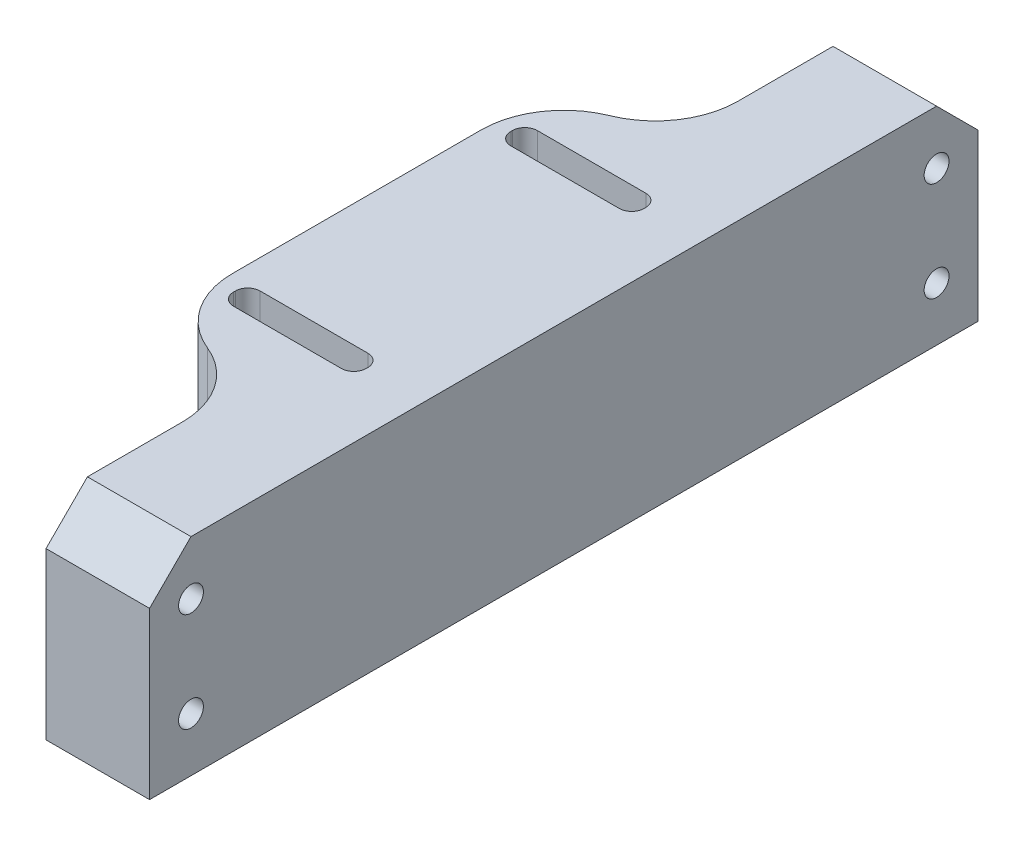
from build123d import *

# Parameters (mm, degrees)
SKETCH_1_W          = 16
SKETCH_1_H          = 3.2
SKETCH_1_W_2        = 16.095473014
EXTRUDE_1_DEPTH     = 25
SKETCH_2_R          = 1.5
CUT_EXTRUDE_1_DEPTH = 58.282196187
SKETCH_3_R          = 1.5
CUT_EXTRUDE_2_DEPTH = 58.282196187
FILLET_6_R          = 10
FILLET_7_R          = 1.5
CHAMFER_1_SIZE      = 5
FILLET_8_R          = 10
SKETCH1_W           = 21
SKETCH1_H           = 8
CUT_EXTRUDE1_DEPTH  = 7


with BuildPart() as part:
    # Sketch 1 → Extrude 1 (new body)
    with BuildSketch(Plane(origin=(0, 0, 0), x_dir=(1, 0, 0), z_dir=(0, 1, 0))):
        Polygon((-12.5, -25), (0, -25), (0, -50), (12.5, -50), (12.5, 50), (0, 50), (0, 25), (-12.5, 25), align=None)
        with Locations((-2.5, -16.75)):
            Rectangle(SKETCH_1_W, SKETCH_1_H, mode=Mode.SUBTRACT)
        with Locations((-2.5, 16.75)):
            Rectangle(SKETCH_1_W_2, SKETCH_1_H, mode=Mode.SUBTRACT)
    extrude(amount=EXTRUDE_1_DEPTH)

    # Sketch 2 → Cut-Extrude 1 (cut, through all)
    with BuildSketch(Plane.ZY):
        with Locations((-45, 6.5)):
            Circle(SKETCH_2_R)
        with Locations((-45, 18.5)):
            Circle(SKETCH_2_R)
    extrude(amount=-CUT_EXTRUDE_1_DEPTH, mode=Mode.SUBTRACT)

    # Sketch 3 → Cut-Extrude 2 (cut, through all)
    with BuildSketch(Plane.ZY):
        with Locations((45, 6.5)):
            Circle(SKETCH_3_R)
        with Locations((45, 18.5)):
            Circle(SKETCH_3_R)
    extrude(amount=-CUT_EXTRUDE_2_DEPTH, mode=Mode.SUBTRACT)

    # Fillet 6
    fillet_6_edges = [part.edges().sort_by_distance(p)[0] for p in [
        (-12.5, 12.5, 25),
        (-12.5, 12.5, -25),
    ]]
    fillet(fillet_6_edges, radius=FILLET_6_R)

    # Fillet 7
    fillet_7_edges = [part.edges().sort_by_distance(p)[0] for p in [
        (-10.5, 12.5, 15.15),
        (-10.5, 12.5, 18.35),
        (5.5, 12.5, 18.35),
        (5.5, 12.5, 15.15),
        (-10.547736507, 12.5, -18.35),
        (-10.547736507, 12.5, -15.15),
        (5.547736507, 12.5, -15.15),
        (5.547736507, 12.5, -18.35),
    ]]
    fillet(fillet_7_edges, radius=FILLET_7_R)

    # Chamfer 1
    chamfer_1_edges = [part.edges().sort_by_distance(p)[0] for p in [
        (6.25, 25, 50),
        (6.25, 25, -50),
    ]]
    chamfer(chamfer_1_edges, length=CHAMFER_1_SIZE)

    # Fillet 8
    fillet_8_edges = [part.edges().sort_by_distance(p)[0] for p in [
        (0, 12.5, 25),
        (0, 12.5, -25),
    ]]
    fillet(fillet_8_edges, radius=FILLET_8_R)

    # Sketch1 → Cut-Extrude1 (cut)
    with BuildSketch(Plane.XZ):
        with Locations((-2, 16.75)):
            Rectangle(SKETCH1_W, SKETCH1_H)
        with Locations((-2, -16.75)):
            Rectangle(SKETCH1_W, SKETCH1_H)
    extrude(amount=-CUT_EXTRUDE1_DEPTH, mode=Mode.SUBTRACT)


solid = part.part
